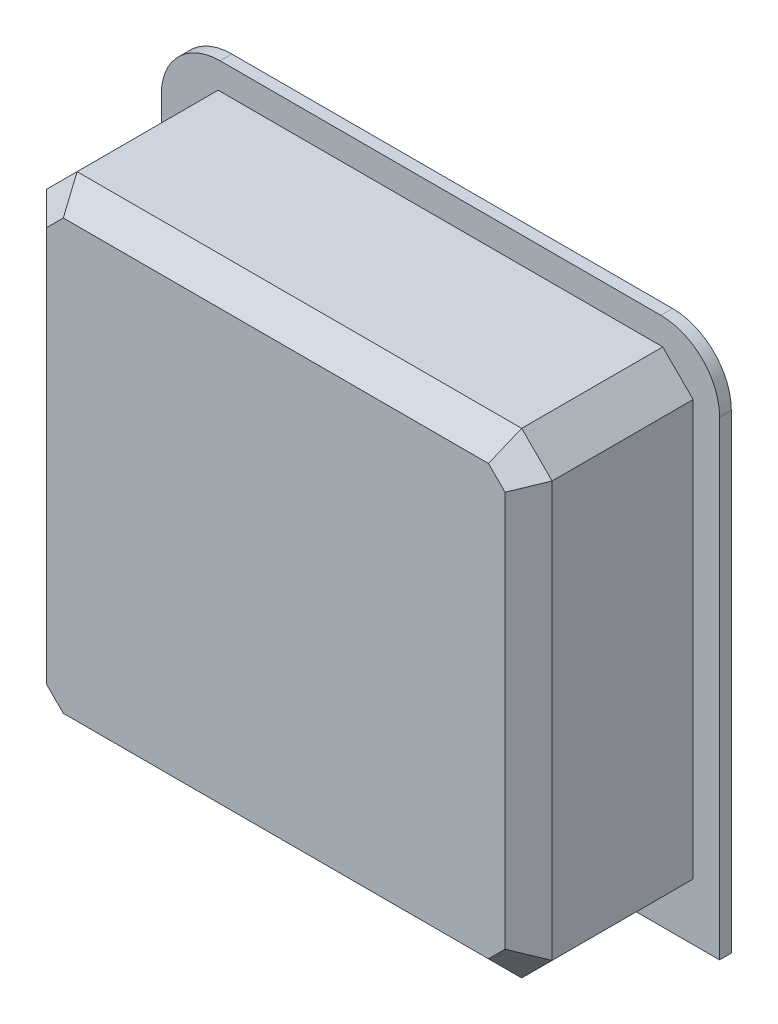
ISO-10303-21;
HEADER;
FILE_DESCRIPTION(('STEP AP214'),'2;1');
FILE_NAME('part.step','',(''),(''),'','','');
FILE_SCHEMA(('AUTOMOTIVE_DESIGN { 1 0 10303 214 1 1 1 1 }'));
ENDSEC;
DATA;
#1=APPLICATION_CONTEXT('core data for automotive mechanical design processes');
#2=APPLICATION_PROTOCOL_DEFINITION('international standard','automotive_design',2000,#1);
#3=PRODUCT_CONTEXT('',#1,'mechanical');
#4=PRODUCT('Part','Part','',(#3));
#5=PRODUCT_RELATED_PRODUCT_CATEGORY('part','',(#4));
#6=PRODUCT_DEFINITION_FORMATION('','',#4);
#7=PRODUCT_DEFINITION_CONTEXT('part definition',#1,'design');
#8=PRODUCT_DEFINITION('design','',#6,#7);
#9=PRODUCT_DEFINITION_SHAPE('','',#8);
#10=(LENGTH_UNIT() NAMED_UNIT(*) SI_UNIT(.MILLI.,.METRE.));
#11=(NAMED_UNIT(*) PLANE_ANGLE_UNIT() SI_UNIT($,.RADIAN.));
#12=(NAMED_UNIT(*) SI_UNIT($,.STERADIAN.) SOLID_ANGLE_UNIT());
#13=UNCERTAINTY_MEASURE_WITH_UNIT(LENGTH_MEASURE(1.E-05),#10,'distance_accuracy_value','');
#14=(GEOMETRIC_REPRESENTATION_CONTEXT(3) GLOBAL_UNCERTAINTY_ASSIGNED_CONTEXT((#13)) GLOBAL_UNIT_ASSIGNED_CONTEXT((#10,
#11,#12)) REPRESENTATION_CONTEXT('',''));
#15=CARTESIAN_POINT('',(0.,0.,0.));
#16=DIRECTION('',(0.,0.,1.));
#17=DIRECTION('',(1.,0.,0.));
#18=AXIS2_PLACEMENT_3D('',#15,#16,#17);
#19=CARTESIAN_POINT('',(-47.5,-45.,30.));
#20=DIRECTION('',(1.,0.,0.));
#21=DIRECTION('',(0.,0.,-1.));
#22=AXIS2_PLACEMENT_3D('',#19,#20,#21);
#23=PLANE('',#22);
#24=DIRECTION('',(0.,1.,0.));
#25=VECTOR('',#24,1.);
#26=CARTESIAN_POINT('',(-47.5,45.,4.));
#27=LINE('',#26,#25);
#28=CARTESIAN_POINT('',(-47.5,-45.,4.));
#29=VERTEX_POINT('',#28);
#30=CARTESIAN_POINT('',(-47.5,35.,4.));
#31=VERTEX_POINT('',#30);
#32=EDGE_CURVE('E407',#29,#31,#27,.T.);
#33=ORIENTED_EDGE('',*,*,#32,.T.);
#34=DIRECTION('',(0.,0.,-1.));
#35=VECTOR('',#34,1.);
#36=CARTESIAN_POINT('',(-47.5,35.,30.));
#37=LINE('',#36,#35);
#38=CARTESIAN_POINT('',(-47.5,35.,2.));
#39=VERTEX_POINT('',#38);
#40=EDGE_CURVE('E11',#31,#39,#37,.T.);
#41=ORIENTED_EDGE('',*,*,#40,.T.);
#42=DIRECTION('',(0.,1.,0.));
#43=VECTOR('',#42,1.);
#44=CARTESIAN_POINT('',(-47.5,45.,2.));
#45=LINE('',#44,#43);
#46=CARTESIAN_POINT('',(-47.5,-45.,2.));
#47=VERTEX_POINT('',#46);
#48=EDGE_CURVE('E421',#47,#39,#45,.T.);
#49=ORIENTED_EDGE('',*,*,#48,.F.);
#50=DIRECTION('',(0.,0.,-1.));
#51=VECTOR('',#50,1.);
#52=CARTESIAN_POINT('',(-47.5,-45.,30.));
#53=LINE('',#52,#51);
#54=EDGE_CURVE('E324',#29,#47,#53,.T.);
#55=ORIENTED_EDGE('',*,*,#54,.F.);
#56=EDGE_LOOP('',(#33,#41,#49,#55));
#57=FACE_BOUND('',#56,.T.);
#58=ADVANCED_FACE('F33',(#57),#23,.F.);
#59=CARTESIAN_POINT('',(47.5,-45.,30.));
#60=DIRECTION('',(0.,1.,0.));
#61=DIRECTION('',(-1.,0.,0.));
#62=AXIS2_PLACEMENT_3D('',#59,#60,#61);
#63=PLANE('',#62);
#64=DIRECTION('',(0.,0.,-1.));
#65=VECTOR('',#64,1.);
#66=CARTESIAN_POINT('',(47.5,-45.,30.));
#67=LINE('',#66,#65);
#68=CARTESIAN_POINT('',(47.5,-45.,4.));
#69=VERTEX_POINT('',#68);
#70=CARTESIAN_POINT('',(47.5,-45.,2.));
#71=VERTEX_POINT('',#70);
#72=EDGE_CURVE('E321',#69,#71,#67,.T.);
#73=ORIENTED_EDGE('',*,*,#72,.F.);
#74=DIRECTION('',(-1.,0.,0.));
#75=VECTOR('',#74,1.);
#76=CARTESIAN_POINT('',(47.5,-45.,4.));
#77=LINE('',#76,#75);
#78=EDGE_CURVE('E526',#69,#29,#77,.T.);
#79=ORIENTED_EDGE('',*,*,#78,.T.);
#80=ORIENTED_EDGE('',*,*,#54,.T.);
#81=DIRECTION('',(-1.,0.,0.));
#82=VECTOR('',#81,1.);
#83=CARTESIAN_POINT('',(47.5,-45.,2.));
#84=LINE('',#83,#82);
#85=EDGE_CURVE('E418',#71,#47,#84,.T.);
#86=ORIENTED_EDGE('',*,*,#85,.F.);
#87=EDGE_LOOP('',(#73,#79,#80,#86));
#88=FACE_BOUND('',#87,.T.);
#89=ADVANCED_FACE('F474',(#88),#63,.F.);
#90=CARTESIAN_POINT('',(47.5,-45.,30.));
#91=DIRECTION('',(-1.,0.,0.));
#92=DIRECTION('',(0.,0.,1.));
#93=AXIS2_PLACEMENT_3D('',#90,#91,#92);
#94=PLANE('',#93);
#95=DIRECTION('',(0.,-1.,0.));
#96=VECTOR('',#95,1.);
#97=CARTESIAN_POINT('',(47.5,45.,2.));
#98=LINE('',#97,#96);
#99=CARTESIAN_POINT('',(47.5,35.,2.));
#100=VERTEX_POINT('',#99);
#101=EDGE_CURVE('E414',#100,#71,#98,.T.);
#102=ORIENTED_EDGE('',*,*,#101,.F.);
#103=DIRECTION('',(0.,0.,-1.));
#104=VECTOR('',#103,1.);
#105=CARTESIAN_POINT('',(47.5,35.,30.));
#106=LINE('',#105,#104);
#107=CARTESIAN_POINT('',(47.5,35.,4.));
#108=VERTEX_POINT('',#107);
#109=EDGE_CURVE('E56',#100,#108,#106,.F.);
#110=ORIENTED_EDGE('',*,*,#109,.T.);
#111=DIRECTION('',(0.,-1.,0.));
#112=VECTOR('',#111,1.);
#113=CARTESIAN_POINT('',(47.5,45.,4.));
#114=LINE('',#113,#112);
#115=EDGE_CURVE('E398',#108,#69,#114,.T.);
#116=ORIENTED_EDGE('',*,*,#115,.T.);
#117=ORIENTED_EDGE('',*,*,#72,.T.);
#118=EDGE_LOOP('',(#102,#110,#116,#117));
#119=FACE_BOUND('',#118,.T.);
#120=ADVANCED_FACE('F415',(#119),#94,.F.);
#121=CARTESIAN_POINT('',(47.5,45.,30.));
#122=DIRECTION('',(0.,-1.,0.));
#123=DIRECTION('',(1.,0.,0.));
#124=AXIS2_PLACEMENT_3D('',#121,#122,#123);
#125=PLANE('',#124);
#126=DIRECTION('',(1.,0.,0.));
#127=VECTOR('',#126,1.);
#128=CARTESIAN_POINT('',(47.5,45.,4.));
#129=LINE('',#128,#127);
#130=CARTESIAN_POINT('',(-37.5,45.,4.));
#131=VERTEX_POINT('',#130);
#132=CARTESIAN_POINT('',(37.5,45.,4.));
#133=VERTEX_POINT('',#132);
#134=EDGE_CURVE('E396',#131,#133,#129,.T.);
#135=ORIENTED_EDGE('',*,*,#134,.T.);
#136=DIRECTION('',(0.,0.,-1.));
#137=VECTOR('',#136,1.);
#138=CARTESIAN_POINT('',(37.5,45.,30.));
#139=LINE('',#138,#137);
#140=CARTESIAN_POINT('',(37.5,45.,2.));
#141=VERTEX_POINT('',#140);
#142=EDGE_CURVE('E385',#133,#141,#139,.T.);
#143=ORIENTED_EDGE('',*,*,#142,.T.);
#144=DIRECTION('',(1.,0.,0.));
#145=VECTOR('',#144,1.);
#146=CARTESIAN_POINT('',(47.5,45.,2.));
#147=LINE('',#146,#145);
#148=CARTESIAN_POINT('',(-37.5,45.,2.));
#149=VERTEX_POINT('',#148);
#150=EDGE_CURVE('E290',#149,#141,#147,.T.);
#151=ORIENTED_EDGE('',*,*,#150,.F.);
#152=DIRECTION('',(0.,0.,-1.));
#153=VECTOR('',#152,1.);
#154=CARTESIAN_POINT('',(-37.5,45.,30.));
#155=LINE('',#154,#153);
#156=EDGE_CURVE('E360',#149,#131,#155,.F.);
#157=ORIENTED_EDGE('',*,*,#156,.T.);
#158=EDGE_LOOP('',(#135,#143,#151,#157));
#159=FACE_BOUND('',#158,.T.);
#160=ADVANCED_FACE('F402',(#159),#125,.F.);
#161=CARTESIAN_POINT('',(0.,0.,0.));
#162=DIRECTION('',(0.,0.,1.));
#163=DIRECTION('',(1.,0.,0.));
#164=AXIS2_PLACEMENT_3D('',#161,#162,#163);
#165=PLANE('',#164);
#166=DIRECTION('',(0.707106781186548,-0.707106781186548,0.));
#167=VECTOR('',#166,1.);
#168=CARTESIAN_POINT('',(43.,35.3284271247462,0.));
#169=LINE('',#168,#167);
#170=CARTESIAN_POINT('',(37.8284271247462,40.5,0.));
#171=VERTEX_POINT('',#170);
#172=CARTESIAN_POINT('',(43.,35.3284271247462,0.));
#173=VERTEX_POINT('',#172);
#174=EDGE_CURVE('E592',#171,#173,#169,.T.);
#175=ORIENTED_EDGE('',*,*,#174,.T.);
#176=DIRECTION('',(0.,-1.,0.));
#177=VECTOR('',#176,1.);
#178=CARTESIAN_POINT('',(43.,35.3284271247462,0.));
#179=LINE('',#178,#177);
#180=CARTESIAN_POINT('',(43.,-35.3284271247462,0.));
#181=VERTEX_POINT('',#180);
#182=EDGE_CURVE('E570',#173,#181,#179,.T.);
#183=ORIENTED_EDGE('',*,*,#182,.T.);
#184=DIRECTION('',(-0.707106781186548,-0.707106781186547,0.));
#185=VECTOR('',#184,1.);
#186=CARTESIAN_POINT('',(43.,-35.3284271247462,0.));
#187=LINE('',#186,#185);
#188=CARTESIAN_POINT('',(37.8284271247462,-40.5,0.));
#189=VERTEX_POINT('',#188);
#190=EDGE_CURVE('E573',#181,#189,#187,.T.);
#191=ORIENTED_EDGE('',*,*,#190,.T.);
#192=DIRECTION('',(-1.,0.,0.));
#193=VECTOR('',#192,1.);
#194=CARTESIAN_POINT('',(37.8284271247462,-40.5,0.));
#195=LINE('',#194,#193);
#196=CARTESIAN_POINT('',(-37.8284271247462,-40.5,0.));
#197=VERTEX_POINT('',#196);
#198=EDGE_CURVE('E577',#189,#197,#195,.T.);
#199=ORIENTED_EDGE('',*,*,#198,.T.);
#200=DIRECTION('',(-0.707106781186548,0.707106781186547,0.));
#201=VECTOR('',#200,1.);
#202=CARTESIAN_POINT('',(-43.,-35.3284271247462,0.));
#203=LINE('',#202,#201);
#204=CARTESIAN_POINT('',(-43.,-35.3284271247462,0.));
#205=VERTEX_POINT('',#204);
#206=EDGE_CURVE('E580',#197,#205,#203,.T.);
#207=ORIENTED_EDGE('',*,*,#206,.T.);
#208=DIRECTION('',(0.,1.,0.));
#209=VECTOR('',#208,1.);
#210=CARTESIAN_POINT('',(-43.,35.3284271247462,0.));
#211=LINE('',#210,#209);
#212=CARTESIAN_POINT('',(-43.,35.3284271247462,0.));
#213=VERTEX_POINT('',#212);
#214=EDGE_CURVE('E583',#205,#213,#211,.T.);
#215=ORIENTED_EDGE('',*,*,#214,.T.);
#216=DIRECTION('',(0.707106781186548,0.707106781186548,0.));
#217=VECTOR('',#216,1.);
#218=CARTESIAN_POINT('',(-43.,35.3284271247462,0.));
#219=LINE('',#218,#217);
#220=CARTESIAN_POINT('',(-37.8284271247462,40.5,0.));
#221=VERTEX_POINT('',#220);
#222=EDGE_CURVE('E586',#213,#221,#219,.T.);
#223=ORIENTED_EDGE('',*,*,#222,.T.);
#224=DIRECTION('',(1.,0.,0.));
#225=VECTOR('',#224,1.);
#226=CARTESIAN_POINT('',(37.8284271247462,40.5,0.));
#227=LINE('',#226,#225);
#228=EDGE_CURVE('E589',#221,#171,#227,.T.);
#229=ORIENTED_EDGE('',*,*,#228,.T.);
#230=EDGE_LOOP('',(#175,#183,#191,#199,#207,#215,#223,#229));
#231=FACE_BOUND('',#230,.T.);
#232=DIRECTION('',(-0.70710678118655,-0.707106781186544,0.));
#233=VECTOR('',#232,1.);
#234=CARTESIAN_POINT('',(-41.,34.5,0.));
#235=LINE('',#234,#233);
#236=CARTESIAN_POINT('',(-37.,38.5,0.));
#237=VERTEX_POINT('',#236);
#238=CARTESIAN_POINT('',(-41.,34.5,0.));
#239=VERTEX_POINT('',#238);
#240=EDGE_CURVE('E286',#237,#239,#235,.T.);
#241=ORIENTED_EDGE('',*,*,#240,.T.);
#242=DIRECTION('',(0.,-1.,0.));
#243=VECTOR('',#242,1.);
#244=CARTESIAN_POINT('',(-41.,-34.5,0.));
#245=LINE('',#244,#243);
#246=CARTESIAN_POINT('',(-41.,-34.5,0.));
#247=VERTEX_POINT('',#246);
#248=EDGE_CURVE('E289',#239,#247,#245,.T.);
#249=ORIENTED_EDGE('',*,*,#248,.T.);
#250=DIRECTION('',(0.707106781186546,-0.707106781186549,0.));
#251=VECTOR('',#250,1.);
#252=CARTESIAN_POINT('',(-41.,-34.5,0.));
#253=LINE('',#252,#251);
#254=CARTESIAN_POINT('',(-37.,-38.5,0.));
#255=VERTEX_POINT('',#254);
#256=EDGE_CURVE('E293',#247,#255,#253,.T.);
#257=ORIENTED_EDGE('',*,*,#256,.T.);
#258=DIRECTION('',(1.,0.,0.));
#259=VECTOR('',#258,1.);
#260=CARTESIAN_POINT('',(37.,-38.5,0.));
#261=LINE('',#260,#259);
#262=CARTESIAN_POINT('',(37.,-38.5,0.));
#263=VERTEX_POINT('',#262);
#264=EDGE_CURVE('E296',#255,#263,#261,.T.);
#265=ORIENTED_EDGE('',*,*,#264,.T.);
#266=DIRECTION('',(0.707106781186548,0.707106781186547,0.));
#267=VECTOR('',#266,1.);
#268=CARTESIAN_POINT('',(41.,-34.5,0.));
#269=LINE('',#268,#267);
#270=CARTESIAN_POINT('',(41.,-34.5,0.));
#271=VERTEX_POINT('',#270);
#272=EDGE_CURVE('E299',#263,#271,#269,.T.);
#273=ORIENTED_EDGE('',*,*,#272,.T.);
#274=DIRECTION('',(0.,1.,0.));
#275=VECTOR('',#274,1.);
#276=CARTESIAN_POINT('',(41.,34.5,0.));
#277=LINE('',#276,#275);
#278=CARTESIAN_POINT('',(41.,34.5,0.));
#279=VERTEX_POINT('',#278);
#280=EDGE_CURVE('E302',#271,#279,#277,.T.);
#281=ORIENTED_EDGE('',*,*,#280,.T.);
#282=DIRECTION('',(-0.707106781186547,0.707106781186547,0.));
#283=VECTOR('',#282,1.);
#284=CARTESIAN_POINT('',(37.,38.5,0.));
#285=LINE('',#284,#283);
#286=CARTESIAN_POINT('',(37.,38.5,0.));
#287=VERTEX_POINT('',#286);
#288=EDGE_CURVE('E305',#279,#287,#285,.T.);
#289=ORIENTED_EDGE('',*,*,#288,.T.);
#290=DIRECTION('',(-1.,0.,0.));
#291=VECTOR('',#290,1.);
#292=CARTESIAN_POINT('',(-37.,38.5,0.));
#293=LINE('',#292,#291);
#294=EDGE_CURVE('E272',#287,#237,#293,.T.);
#295=ORIENTED_EDGE('',*,*,#294,.T.);
#296=EDGE_LOOP('',(#241,#249,#257,#265,#273,#281,#289,#295));
#297=FACE_BOUND('',#296,.T.);
#298=ADVANCED_FACE('F450',(#231,#297),#165,.F.);
#299=CARTESIAN_POINT('',(-41.,34.5,30.));
#300=DIRECTION('',(0.707106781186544,-0.70710678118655,0.));
#301=DIRECTION('',(0.707106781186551,0.707106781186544,0.));
#302=AXIS2_PLACEMENT_3D('',#299,#300,#301);
#303=PLANE('',#302);
#304=ORIENTED_EDGE('',*,*,#240,.F.);
#305=DIRECTION('',(0.,0.,-1.));
#306=VECTOR('',#305,1.);
#307=CARTESIAN_POINT('',(-37.,38.5,30.));
#308=LINE('',#307,#306);
#309=CARTESIAN_POINT('',(-37.,38.5,30.));
#310=VERTEX_POINT('',#309);
#311=EDGE_CURVE('E266',#310,#237,#308,.T.);
#312=ORIENTED_EDGE('',*,*,#311,.F.);
#313=DIRECTION('',(-0.70710678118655,-0.707106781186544,0.));
#314=VECTOR('',#313,1.);
#315=CARTESIAN_POINT('',(-41.,34.5,30.));
#316=LINE('',#315,#314);
#317=CARTESIAN_POINT('',(-41.,34.5,30.));
#318=VERTEX_POINT('',#317);
#319=EDGE_CURVE('E262',#310,#318,#316,.T.);
#320=ORIENTED_EDGE('',*,*,#319,.T.);
#321=DIRECTION('',(0.,0.,-1.));
#322=VECTOR('',#321,1.);
#323=CARTESIAN_POINT('',(-41.,34.5,30.));
#324=LINE('',#323,#322);
#325=EDGE_CURVE('E318',#318,#239,#324,.T.);
#326=ORIENTED_EDGE('',*,*,#325,.T.);
#327=EDGE_LOOP('',(#304,#312,#320,#326));
#328=FACE_BOUND('',#327,.T.);
#329=ADVANCED_FACE('F463',(#328),#303,.T.);
#330=CARTESIAN_POINT('',(-41.,-34.5,30.));
#331=DIRECTION('',(1.,0.,0.));
#332=DIRECTION('',(0.,1.,0.));
#333=AXIS2_PLACEMENT_3D('',#330,#331,#332);
#334=PLANE('',#333);
#335=ORIENTED_EDGE('',*,*,#248,.F.);
#336=ORIENTED_EDGE('',*,*,#325,.F.);
#337=DIRECTION('',(0.,-1.,0.));
#338=VECTOR('',#337,1.);
#339=CARTESIAN_POINT('',(-41.,-34.5,30.));
#340=LINE('',#339,#338);
#341=CARTESIAN_POINT('',(-41.,-34.5,30.));
#342=VERTEX_POINT('',#341);
#343=EDGE_CURVE('E432',#318,#342,#340,.T.);
#344=ORIENTED_EDGE('',*,*,#343,.T.);
#345=DIRECTION('',(0.,0.,-1.));
#346=VECTOR('',#345,1.);
#347=CARTESIAN_POINT('',(-41.,-34.5,30.));
#348=LINE('',#347,#346);
#349=EDGE_CURVE('E316',#342,#247,#348,.T.);
#350=ORIENTED_EDGE('',*,*,#349,.T.);
#351=EDGE_LOOP('',(#335,#336,#344,#350));
#352=FACE_BOUND('',#351,.T.);
#353=ADVANCED_FACE('F460',(#352),#334,.T.);
#354=CARTESIAN_POINT('',(-41.,-34.5,30.));
#355=DIRECTION('',(0.707106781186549,0.707106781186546,0.));
#356=DIRECTION('',(-0.707106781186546,0.707106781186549,0.));
#357=AXIS2_PLACEMENT_3D('',#354,#355,#356);
#358=PLANE('',#357);
#359=ORIENTED_EDGE('',*,*,#256,.F.);
#360=ORIENTED_EDGE('',*,*,#349,.F.);
#361=DIRECTION('',(0.707106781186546,-0.707106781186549,0.));
#362=VECTOR('',#361,1.);
#363=CARTESIAN_POINT('',(-41.,-34.5,30.));
#364=LINE('',#363,#362);
#365=CARTESIAN_POINT('',(-37.,-38.5,30.));
#366=VERTEX_POINT('',#365);
#367=EDGE_CURVE('E435',#342,#366,#364,.T.);
#368=ORIENTED_EDGE('',*,*,#367,.T.);
#369=DIRECTION('',(0.,0.,-1.));
#370=VECTOR('',#369,1.);
#371=CARTESIAN_POINT('',(-37.,-38.5,30.));
#372=LINE('',#371,#370);
#373=EDGE_CURVE('E314',#366,#255,#372,.T.);
#374=ORIENTED_EDGE('',*,*,#373,.T.);
#375=EDGE_LOOP('',(#359,#360,#368,#374));
#376=FACE_BOUND('',#375,.T.);
#377=ADVANCED_FACE('F458',(#376),#358,.T.);
#378=CARTESIAN_POINT('',(37.,-38.5,30.));
#379=DIRECTION('',(0.,1.,0.));
#380=DIRECTION('',(-1.,0.,0.));
#381=AXIS2_PLACEMENT_3D('',#378,#379,#380);
#382=PLANE('',#381);
#383=ORIENTED_EDGE('',*,*,#264,.F.);
#384=ORIENTED_EDGE('',*,*,#373,.F.);
#385=DIRECTION('',(1.,0.,0.));
#386=VECTOR('',#385,1.);
#387=CARTESIAN_POINT('',(37.,-38.5,30.));
#388=LINE('',#387,#386);
#389=CARTESIAN_POINT('',(37.,-38.5,30.));
#390=VERTEX_POINT('',#389);
#391=EDGE_CURVE('E438',#366,#390,#388,.T.);
#392=ORIENTED_EDGE('',*,*,#391,.T.);
#393=DIRECTION('',(0.,0.,-1.));
#394=VECTOR('',#393,1.);
#395=CARTESIAN_POINT('',(37.,-38.5,30.));
#396=LINE('',#395,#394);
#397=EDGE_CURVE('E312',#390,#263,#396,.T.);
#398=ORIENTED_EDGE('',*,*,#397,.T.);
#399=EDGE_LOOP('',(#383,#384,#392,#398));
#400=FACE_BOUND('',#399,.T.);
#401=ADVANCED_FACE('F455',(#400),#382,.T.);
#402=CARTESIAN_POINT('',(41.,-34.5,30.));
#403=DIRECTION('',(-0.707106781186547,0.707106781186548,0.));
#404=DIRECTION('',(-0.707106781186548,-0.707106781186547,0.));
#405=AXIS2_PLACEMENT_3D('',#402,#403,#404);
#406=PLANE('',#405);
#407=ORIENTED_EDGE('',*,*,#272,.F.);
#408=ORIENTED_EDGE('',*,*,#397,.F.);
#409=DIRECTION('',(0.707106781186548,0.707106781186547,0.));
#410=VECTOR('',#409,1.);
#411=CARTESIAN_POINT('',(41.,-34.5,30.));
#412=LINE('',#411,#410);
#413=CARTESIAN_POINT('',(41.,-34.5,30.));
#414=VERTEX_POINT('',#413);
#415=EDGE_CURVE('E282',#390,#414,#412,.T.);
#416=ORIENTED_EDGE('',*,*,#415,.T.);
#417=DIRECTION('',(0.,0.,-1.));
#418=VECTOR('',#417,1.);
#419=CARTESIAN_POINT('',(41.,-34.5,30.));
#420=LINE('',#419,#418);
#421=EDGE_CURVE('E310',#414,#271,#420,.T.);
#422=ORIENTED_EDGE('',*,*,#421,.T.);
#423=EDGE_LOOP('',(#407,#408,#416,#422));
#424=FACE_BOUND('',#423,.T.);
#425=ADVANCED_FACE('F445',(#424),#406,.T.);
#426=CARTESIAN_POINT('',(41.,34.5,30.));
#427=DIRECTION('',(-1.,0.,0.));
#428=DIRECTION('',(0.,0.,1.));
#429=AXIS2_PLACEMENT_3D('',#426,#427,#428);
#430=PLANE('',#429);
#431=ORIENTED_EDGE('',*,*,#280,.F.);
#432=ORIENTED_EDGE('',*,*,#421,.F.);
#433=DIRECTION('',(0.,1.,0.));
#434=VECTOR('',#433,1.);
#435=CARTESIAN_POINT('',(41.,34.5,30.));
#436=LINE('',#435,#434);
#437=CARTESIAN_POINT('',(41.,34.5,30.));
#438=VERTEX_POINT('',#437);
#439=EDGE_CURVE('E280',#414,#438,#436,.T.);
#440=ORIENTED_EDGE('',*,*,#439,.T.);
#441=DIRECTION('',(0.,0.,-1.));
#442=VECTOR('',#441,1.);
#443=CARTESIAN_POINT('',(41.,34.5,30.));
#444=LINE('',#443,#442);
#445=EDGE_CURVE('E276',#438,#279,#444,.T.);
#446=ORIENTED_EDGE('',*,*,#445,.T.);
#447=EDGE_LOOP('',(#431,#432,#440,#446));
#448=FACE_BOUND('',#447,.T.);
#449=ADVANCED_FACE('F448',(#448),#430,.T.);
#450=CARTESIAN_POINT('',(37.,38.5,30.));
#451=DIRECTION('',(-0.707106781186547,-0.707106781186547,0.));
#452=DIRECTION('',(0.707106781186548,-0.707106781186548,0.));
#453=AXIS2_PLACEMENT_3D('',#450,#451,#452);
#454=PLANE('',#453);
#455=ORIENTED_EDGE('',*,*,#288,.F.);
#456=ORIENTED_EDGE('',*,*,#445,.F.);
#457=DIRECTION('',(-0.707106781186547,0.707106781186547,0.));
#458=VECTOR('',#457,1.);
#459=CARTESIAN_POINT('',(37.,38.5,30.));
#460=LINE('',#459,#458);
#461=CARTESIAN_POINT('',(37.,38.5,30.));
#462=VERTEX_POINT('',#461);
#463=EDGE_CURVE('E259',#438,#462,#460,.T.);
#464=ORIENTED_EDGE('',*,*,#463,.T.);
#465=DIRECTION('',(0.,0.,-1.));
#466=VECTOR('',#465,1.);
#467=CARTESIAN_POINT('',(37.,38.5,30.));
#468=LINE('',#467,#466);
#469=EDGE_CURVE('E269',#462,#287,#468,.T.);
#470=ORIENTED_EDGE('',*,*,#469,.T.);
#471=EDGE_LOOP('',(#455,#456,#464,#470));
#472=FACE_BOUND('',#471,.T.);
#473=ADVANCED_FACE('F279',(#472),#454,.T.);
#474=CARTESIAN_POINT('',(-37.,38.5,30.));
#475=DIRECTION('',(0.,-1.,0.));
#476=DIRECTION('',(1.,0.,0.));
#477=AXIS2_PLACEMENT_3D('',#474,#475,#476);
#478=PLANE('',#477);
#479=ORIENTED_EDGE('',*,*,#294,.F.);
#480=ORIENTED_EDGE('',*,*,#469,.F.);
#481=DIRECTION('',(-1.,0.,0.));
#482=VECTOR('',#481,1.);
#483=CARTESIAN_POINT('',(-37.,38.5,30.));
#484=LINE('',#483,#482);
#485=EDGE_CURVE('E255',#462,#310,#484,.T.);
#486=ORIENTED_EDGE('',*,*,#485,.T.);
#487=ORIENTED_EDGE('',*,*,#311,.T.);
#488=EDGE_LOOP('',(#479,#480,#486,#487));
#489=FACE_BOUND('',#488,.T.);
#490=ADVANCED_FACE('F270',(#489),#478,.T.);
#491=CARTESIAN_POINT('',(0.,0.,2.));
#492=DIRECTION('',(0.,0.,-1.));
#493=DIRECTION('',(-1.,0.,0.));
#494=AXIS2_PLACEMENT_3D('',#491,#492,#493);
#495=PLANE('',#494);
#496=ORIENTED_EDGE('',*,*,#150,.T.);
#497=CARTESIAN_POINT('',(37.5,35.,2.));
#498=DIRECTION('',(0.,0.,-1.));
#499=DIRECTION('',(-1.,0.,0.));
#500=AXIS2_PLACEMENT_3D('',#497,#498,#499);
#501=CIRCLE('',#500,10.);
#502=EDGE_CURVE('E390',#141,#100,#501,.T.);
#503=ORIENTED_EDGE('',*,*,#502,.T.);
#504=ORIENTED_EDGE('',*,*,#101,.T.);
#505=ORIENTED_EDGE('',*,*,#85,.T.);
#506=ORIENTED_EDGE('',*,*,#48,.T.);
#507=CARTESIAN_POINT('',(-37.5,35.,2.));
#508=DIRECTION('',(0.,0.,-1.));
#509=DIRECTION('',(-1.,0.,0.));
#510=AXIS2_PLACEMENT_3D('',#507,#508,#509);
#511=CIRCLE('',#510,10.);
#512=EDGE_CURVE('E388',#39,#149,#511,.T.);
#513=ORIENTED_EDGE('',*,*,#512,.T.);
#514=EDGE_LOOP('',(#496,#503,#504,#505,#506,#513));
#515=FACE_BOUND('',#514,.T.);
#516=DIRECTION('',(0.,-1.,0.));
#517=VECTOR('',#516,1.);
#518=CARTESIAN_POINT('',(43.,35.3284271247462,2.));
#519=LINE('',#518,#517);
#520=CARTESIAN_POINT('',(43.,35.3284271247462,2.));
#521=VERTEX_POINT('',#520);
#522=CARTESIAN_POINT('',(43.,-35.3284271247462,2.));
#523=VERTEX_POINT('',#522);
#524=EDGE_CURVE('E406',#521,#523,#519,.T.);
#525=ORIENTED_EDGE('',*,*,#524,.F.);
#526=DIRECTION('',(0.707106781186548,-0.707106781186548,0.));
#527=VECTOR('',#526,1.);
#528=CARTESIAN_POINT('',(43.,35.3284271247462,2.));
#529=LINE('',#528,#527);
#530=CARTESIAN_POINT('',(37.8284271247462,40.5,2.));
#531=VERTEX_POINT('',#530);
#532=EDGE_CURVE('E574',#531,#521,#529,.T.);
#533=ORIENTED_EDGE('',*,*,#532,.F.);
#534=DIRECTION('',(1.,0.,0.));
#535=VECTOR('',#534,1.);
#536=CARTESIAN_POINT('',(37.8284271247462,40.5,2.));
#537=LINE('',#536,#535);
#538=CARTESIAN_POINT('',(-37.8284271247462,40.5,2.));
#539=VERTEX_POINT('',#538);
#540=EDGE_CURVE('E613',#539,#531,#537,.T.);
#541=ORIENTED_EDGE('',*,*,#540,.F.);
#542=DIRECTION('',(0.707106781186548,0.707106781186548,0.));
#543=VECTOR('',#542,1.);
#544=CARTESIAN_POINT('',(-43.,35.3284271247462,2.));
#545=LINE('',#544,#543);
#546=CARTESIAN_POINT('',(-43.,35.3284271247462,2.));
#547=VERTEX_POINT('',#546);
#548=EDGE_CURVE('E610',#547,#539,#545,.T.);
#549=ORIENTED_EDGE('',*,*,#548,.F.);
#550=DIRECTION('',(0.,1.,0.));
#551=VECTOR('',#550,1.);
#552=CARTESIAN_POINT('',(-43.,35.3284271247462,2.));
#553=LINE('',#552,#551);
#554=CARTESIAN_POINT('',(-43.,-35.3284271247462,2.));
#555=VERTEX_POINT('',#554);
#556=EDGE_CURVE('E607',#555,#547,#553,.T.);
#557=ORIENTED_EDGE('',*,*,#556,.F.);
#558=DIRECTION('',(-0.707106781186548,0.707106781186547,0.));
#559=VECTOR('',#558,1.);
#560=CARTESIAN_POINT('',(-43.,-35.3284271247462,2.));
#561=LINE('',#560,#559);
#562=CARTESIAN_POINT('',(-37.8284271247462,-40.5,2.));
#563=VERTEX_POINT('',#562);
#564=EDGE_CURVE('E604',#563,#555,#561,.T.);
#565=ORIENTED_EDGE('',*,*,#564,.F.);
#566=DIRECTION('',(-1.,0.,0.));
#567=VECTOR('',#566,1.);
#568=CARTESIAN_POINT('',(37.8284271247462,-40.5,2.));
#569=LINE('',#568,#567);
#570=CARTESIAN_POINT('',(37.8284271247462,-40.5,2.));
#571=VERTEX_POINT('',#570);
#572=EDGE_CURVE('E601',#571,#563,#569,.T.);
#573=ORIENTED_EDGE('',*,*,#572,.F.);
#574=DIRECTION('',(-0.707106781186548,-0.707106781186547,0.));
#575=VECTOR('',#574,1.);
#576=CARTESIAN_POINT('',(43.,-35.3284271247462,2.));
#577=LINE('',#576,#575);
#578=EDGE_CURVE('E598',#523,#571,#577,.T.);
#579=ORIENTED_EDGE('',*,*,#578,.F.);
#580=EDGE_LOOP('',(#525,#533,#541,#549,#557,#565,#573,#579));
#581=FACE_BOUND('',#580,.T.);
#582=ADVANCED_FACE('F411',(#515,#581),#495,.T.);
#583=CARTESIAN_POINT('',(43.,35.3284271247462,0.));
#584=DIRECTION('',(-1.,0.,0.));
#585=DIRECTION('',(0.,-1.,0.));
#586=AXIS2_PLACEMENT_3D('',#583,#584,#585);
#587=PLANE('',#586);
#588=ORIENTED_EDGE('',*,*,#524,.T.);
#589=DIRECTION('',(0.,0.,1.));
#590=VECTOR('',#589,1.);
#591=CARTESIAN_POINT('',(43.,-35.3284271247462,0.));
#592=LINE('',#591,#590);
#593=EDGE_CURVE('E419',#181,#523,#592,.T.);
#594=ORIENTED_EDGE('',*,*,#593,.F.);
#595=ORIENTED_EDGE('',*,*,#182,.F.);
#596=DIRECTION('',(0.,0.,1.));
#597=VECTOR('',#596,1.);
#598=CARTESIAN_POINT('',(43.,35.3284271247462,0.));
#599=LINE('',#598,#597);
#600=EDGE_CURVE('E595',#173,#521,#599,.T.);
#601=ORIENTED_EDGE('',*,*,#600,.T.);
#602=EDGE_LOOP('',(#588,#594,#595,#601));
#603=FACE_BOUND('',#602,.T.);
#604=ADVANCED_FACE('F639',(#603),#587,.F.);
#605=CARTESIAN_POINT('',(43.,-35.3284271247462,0.));
#606=DIRECTION('',(-0.707106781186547,0.707106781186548,0.));
#607=DIRECTION('',(-0.707106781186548,-0.707106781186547,0.));
#608=AXIS2_PLACEMENT_3D('',#605,#606,#607);
#609=PLANE('',#608);
#610=ORIENTED_EDGE('',*,*,#578,.T.);
#611=DIRECTION('',(0.,0.,1.));
#612=VECTOR('',#611,1.);
#613=CARTESIAN_POINT('',(37.8284271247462,-40.5,0.));
#614=LINE('',#613,#612);
#615=EDGE_CURVE('E424',#189,#571,#614,.T.);
#616=ORIENTED_EDGE('',*,*,#615,.F.);
#617=ORIENTED_EDGE('',*,*,#190,.F.);
#618=ORIENTED_EDGE('',*,*,#593,.T.);
#619=EDGE_LOOP('',(#610,#616,#617,#618));
#620=FACE_BOUND('',#619,.T.);
#621=ADVANCED_FACE('F637',(#620),#609,.F.);
#622=CARTESIAN_POINT('',(37.8284271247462,-40.5,0.));
#623=DIRECTION('',(0.,1.,0.));
#624=DIRECTION('',(0.,0.,1.));
#625=AXIS2_PLACEMENT_3D('',#622,#623,#624);
#626=PLANE('',#625);
#627=ORIENTED_EDGE('',*,*,#572,.T.);
#628=DIRECTION('',(0.,0.,1.));
#629=VECTOR('',#628,1.);
#630=CARTESIAN_POINT('',(-37.8284271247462,-40.5,0.));
#631=LINE('',#630,#629);
#632=EDGE_CURVE('E628',#197,#563,#631,.T.);
#633=ORIENTED_EDGE('',*,*,#632,.F.);
#634=ORIENTED_EDGE('',*,*,#198,.F.);
#635=ORIENTED_EDGE('',*,*,#615,.T.);
#636=EDGE_LOOP('',(#627,#633,#634,#635));
#637=FACE_BOUND('',#636,.T.);
#638=ADVANCED_FACE('F632',(#637),#626,.F.);
#639=CARTESIAN_POINT('',(-43.,-35.3284271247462,0.));
#640=DIRECTION('',(0.707106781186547,0.707106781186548,0.));
#641=DIRECTION('',(-0.707106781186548,0.707106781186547,0.));
#642=AXIS2_PLACEMENT_3D('',#639,#640,#641);
#643=PLANE('',#642);
#644=ORIENTED_EDGE('',*,*,#564,.T.);
#645=DIRECTION('',(0.,0.,1.));
#646=VECTOR('',#645,1.);
#647=CARTESIAN_POINT('',(-43.,-35.3284271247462,0.));
#648=LINE('',#647,#646);
#649=EDGE_CURVE('E626',#205,#555,#648,.T.);
#650=ORIENTED_EDGE('',*,*,#649,.F.);
#651=ORIENTED_EDGE('',*,*,#206,.F.);
#652=ORIENTED_EDGE('',*,*,#632,.T.);
#653=EDGE_LOOP('',(#644,#650,#651,#652));
#654=FACE_BOUND('',#653,.T.);
#655=ADVANCED_FACE('F657',(#654),#643,.F.);
#656=CARTESIAN_POINT('',(-43.,35.3284271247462,0.));
#657=DIRECTION('',(1.,0.,0.));
#658=DIRECTION('',(0.,1.,0.));
#659=AXIS2_PLACEMENT_3D('',#656,#657,#658);
#660=PLANE('',#659);
#661=ORIENTED_EDGE('',*,*,#556,.T.);
#662=DIRECTION('',(0.,0.,1.));
#663=VECTOR('',#662,1.);
#664=CARTESIAN_POINT('',(-43.,35.3284271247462,0.));
#665=LINE('',#664,#663);
#666=EDGE_CURVE('E624',#213,#547,#665,.T.);
#667=ORIENTED_EDGE('',*,*,#666,.F.);
#668=ORIENTED_EDGE('',*,*,#214,.F.);
#669=ORIENTED_EDGE('',*,*,#649,.T.);
#670=EDGE_LOOP('',(#661,#667,#668,#669));
#671=FACE_BOUND('',#670,.T.);
#672=ADVANCED_FACE('F653',(#671),#660,.F.);
#673=CARTESIAN_POINT('',(-43.,35.3284271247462,0.));
#674=DIRECTION('',(0.707106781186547,-0.707106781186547,0.));
#675=DIRECTION('',(0.707106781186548,0.707106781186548,0.));
#676=AXIS2_PLACEMENT_3D('',#673,#674,#675);
#677=PLANE('',#676);
#678=ORIENTED_EDGE('',*,*,#548,.T.);
#679=DIRECTION('',(0.,0.,1.));
#680=VECTOR('',#679,1.);
#681=CARTESIAN_POINT('',(-37.8284271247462,40.5,0.));
#682=LINE('',#681,#680);
#683=EDGE_CURVE('E622',#221,#539,#682,.T.);
#684=ORIENTED_EDGE('',*,*,#683,.F.);
#685=ORIENTED_EDGE('',*,*,#222,.F.);
#686=ORIENTED_EDGE('',*,*,#666,.T.);
#687=EDGE_LOOP('',(#678,#684,#685,#686));
#688=FACE_BOUND('',#687,.T.);
#689=ADVANCED_FACE('F651',(#688),#677,.F.);
#690=CARTESIAN_POINT('',(37.8284271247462,40.5,0.));
#691=DIRECTION('',(0.,-1.,0.));
#692=DIRECTION('',(0.,0.,-1.));
#693=AXIS2_PLACEMENT_3D('',#690,#691,#692);
#694=PLANE('',#693);
#695=ORIENTED_EDGE('',*,*,#540,.T.);
#696=DIRECTION('',(0.,0.,1.));
#697=VECTOR('',#696,1.);
#698=CARTESIAN_POINT('',(37.8284271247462,40.5,0.));
#699=LINE('',#698,#697);
#700=EDGE_CURVE('E620',#171,#531,#699,.T.);
#701=ORIENTED_EDGE('',*,*,#700,.F.);
#702=ORIENTED_EDGE('',*,*,#228,.F.);
#703=ORIENTED_EDGE('',*,*,#683,.T.);
#704=EDGE_LOOP('',(#695,#701,#702,#703));
#705=FACE_BOUND('',#704,.T.);
#706=ADVANCED_FACE('F646',(#705),#694,.F.);
#707=CARTESIAN_POINT('',(43.,35.3284271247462,0.));
#708=DIRECTION('',(-0.707106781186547,-0.707106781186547,0.));
#709=DIRECTION('',(0.707106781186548,-0.707106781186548,0.));
#710=AXIS2_PLACEMENT_3D('',#707,#708,#709);
#711=PLANE('',#710);
#712=ORIENTED_EDGE('',*,*,#532,.T.);
#713=ORIENTED_EDGE('',*,*,#600,.F.);
#714=ORIENTED_EDGE('',*,*,#174,.F.);
#715=ORIENTED_EDGE('',*,*,#700,.T.);
#716=EDGE_LOOP('',(#712,#713,#714,#715));
#717=FACE_BOUND('',#716,.T.);
#718=ADVANCED_FACE('F658',(#717),#711,.F.);
#719=CARTESIAN_POINT('',(-37.8284271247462,40.5,160.862523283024));
#720=DIRECTION('',(0.,1.,0.));
#721=DIRECTION('',(0.,0.,1.));
#722=AXIS2_PLACEMENT_3D('',#719,#720,#721);
#723=PLANE('',#722);
#724=DIRECTION('',(0.,0.,-1.));
#725=VECTOR('',#724,1.);
#726=CARTESIAN_POINT('',(-37.8284271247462,40.5,160.862523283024));
#727=LINE('',#726,#725);
#728=CARTESIAN_POINT('',(-37.8284271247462,40.5,28.));
#729=VERTEX_POINT('',#728);
#730=CARTESIAN_POINT('',(-37.8284271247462,40.5,4.));
#731=VERTEX_POINT('',#730);
#732=EDGE_CURVE('E383',#729,#731,#727,.T.);
#733=ORIENTED_EDGE('',*,*,#732,.F.);
#734=DIRECTION('',(1.,0.,0.));
#735=VECTOR('',#734,1.);
#736=CARTESIAN_POINT('',(37.8284271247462,40.5,28.));
#737=LINE('',#736,#735);
#738=CARTESIAN_POINT('',(37.8284271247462,40.5,28.));
#739=VERTEX_POINT('',#738);
#740=EDGE_CURVE('E346',#729,#739,#737,.T.);
#741=ORIENTED_EDGE('',*,*,#740,.T.);
#742=DIRECTION('',(0.,0.,-1.));
#743=VECTOR('',#742,1.);
#744=CARTESIAN_POINT('',(37.8284271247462,40.5,160.862523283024));
#745=LINE('',#744,#743);
#746=CARTESIAN_POINT('',(37.8284271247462,40.5,4.));
#747=VERTEX_POINT('',#746);
#748=EDGE_CURVE('E556',#739,#747,#745,.T.);
#749=ORIENTED_EDGE('',*,*,#748,.T.);
#750=DIRECTION('',(1.,0.,0.));
#751=VECTOR('',#750,1.);
#752=CARTESIAN_POINT('',(-37.8284271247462,40.5,4.));
#753=LINE('',#752,#751);
#754=EDGE_CURVE('E559',#731,#747,#753,.T.);
#755=ORIENTED_EDGE('',*,*,#754,.F.);
#756=EDGE_LOOP('',(#733,#741,#749,#755));
#757=FACE_BOUND('',#756,.T.);
#758=ADVANCED_FACE('F660',(#757),#723,.T.);
#759=CARTESIAN_POINT('',(-43.,35.3284271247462,160.862523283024));
#760=DIRECTION('',(-0.707106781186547,0.707106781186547,0.));
#761=DIRECTION('',(-0.707106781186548,-0.707106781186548,0.));
#762=AXIS2_PLACEMENT_3D('',#759,#760,#761);
#763=PLANE('',#762);
#764=DIRECTION('',(0.,0.,-1.));
#765=VECTOR('',#764,1.);
#766=CARTESIAN_POINT('',(-43.,35.3284271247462,160.862523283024));
#767=LINE('',#766,#765);
#768=CARTESIAN_POINT('',(-43.,35.3284271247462,28.));
#769=VERTEX_POINT('',#768);
#770=CARTESIAN_POINT('',(-43.,35.3284271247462,4.));
#771=VERTEX_POINT('',#770);
#772=EDGE_CURVE('E536',#769,#771,#767,.T.);
#773=ORIENTED_EDGE('',*,*,#772,.F.);
#774=DIRECTION('',(0.707106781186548,0.707106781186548,0.));
#775=VECTOR('',#774,1.);
#776=CARTESIAN_POINT('',(-37.8284271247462,40.5,28.));
#777=LINE('',#776,#775);
#778=EDGE_CURVE('E343',#769,#729,#777,.T.);
#779=ORIENTED_EDGE('',*,*,#778,.T.);
#780=ORIENTED_EDGE('',*,*,#732,.T.);
#781=DIRECTION('',(0.707106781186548,0.707106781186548,0.));
#782=VECTOR('',#781,1.);
#783=CARTESIAN_POINT('',(-43.,35.3284271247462,4.));
#784=LINE('',#783,#782);
#785=EDGE_CURVE('E532',#771,#731,#784,.T.);
#786=ORIENTED_EDGE('',*,*,#785,.F.);
#787=EDGE_LOOP('',(#773,#779,#780,#786));
#788=FACE_BOUND('',#787,.T.);
#789=ADVANCED_FACE('F666',(#788),#763,.T.);
#790=CARTESIAN_POINT('',(-43.,-35.3284271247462,160.862523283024));
#791=DIRECTION('',(-1.,0.,0.));
#792=DIRECTION('',(0.,-1.,0.));
#793=AXIS2_PLACEMENT_3D('',#790,#791,#792);
#794=PLANE('',#793);
#795=DIRECTION('',(0.,0.,-1.));
#796=VECTOR('',#795,1.);
#797=CARTESIAN_POINT('',(-43.,-35.3284271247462,160.862523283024));
#798=LINE('',#797,#796);
#799=CARTESIAN_POINT('',(-43.,-35.3284271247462,28.));
#800=VERTEX_POINT('',#799);
#801=CARTESIAN_POINT('',(-43.,-35.3284271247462,4.));
#802=VERTEX_POINT('',#801);
#803=EDGE_CURVE('E535',#800,#802,#798,.T.);
#804=ORIENTED_EDGE('',*,*,#803,.F.);
#805=DIRECTION('',(0.,1.,0.));
#806=VECTOR('',#805,1.);
#807=CARTESIAN_POINT('',(-43.,35.3284271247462,28.));
#808=LINE('',#807,#806);
#809=EDGE_CURVE('E358',#800,#769,#808,.T.);
#810=ORIENTED_EDGE('',*,*,#809,.T.);
#811=ORIENTED_EDGE('',*,*,#772,.T.);
#812=DIRECTION('',(0.,1.,0.));
#813=VECTOR('',#812,1.);
#814=CARTESIAN_POINT('',(-43.,-35.3284271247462,4.));
#815=LINE('',#814,#813);
#816=EDGE_CURVE('E537',#802,#771,#815,.T.);
#817=ORIENTED_EDGE('',*,*,#816,.F.);
#818=EDGE_LOOP('',(#804,#810,#811,#817));
#819=FACE_BOUND('',#818,.T.);
#820=ADVANCED_FACE('F922',(#819),#794,.T.);
#821=CARTESIAN_POINT('',(-37.8284271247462,-40.5,160.862523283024));
#822=DIRECTION('',(-0.707106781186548,-0.707106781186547,0.));
#823=DIRECTION('',(0.707106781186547,-0.707106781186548,0.));
#824=AXIS2_PLACEMENT_3D('',#821,#822,#823);
#825=PLANE('',#824);
#826=DIRECTION('',(0.,0.,-1.));
#827=VECTOR('',#826,1.);
#828=CARTESIAN_POINT('',(-37.8284271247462,-40.5,160.862523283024));
#829=LINE('',#828,#827);
#830=CARTESIAN_POINT('',(-37.8284271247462,-40.5,28.));
#831=VERTEX_POINT('',#830);
#832=CARTESIAN_POINT('',(-37.8284271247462,-40.5,4.));
#833=VERTEX_POINT('',#832);
#834=EDGE_CURVE('E540',#831,#833,#829,.T.);
#835=ORIENTED_EDGE('',*,*,#834,.F.);
#836=DIRECTION('',(-0.707106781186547,0.707106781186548,0.));
#837=VECTOR('',#836,1.);
#838=CARTESIAN_POINT('',(-43.,-35.3284271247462,28.));
#839=LINE('',#838,#837);
#840=EDGE_CURVE('E356',#831,#800,#839,.T.);
#841=ORIENTED_EDGE('',*,*,#840,.T.);
#842=ORIENTED_EDGE('',*,*,#803,.T.);
#843=DIRECTION('',(-0.707106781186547,0.707106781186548,0.));
#844=VECTOR('',#843,1.);
#845=CARTESIAN_POINT('',(-37.8284271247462,-40.5,4.));
#846=LINE('',#845,#844);
#847=EDGE_CURVE('E541',#833,#802,#846,.T.);
#848=ORIENTED_EDGE('',*,*,#847,.F.);
#849=EDGE_LOOP('',(#835,#841,#842,#848));
#850=FACE_BOUND('',#849,.T.);
#851=ADVANCED_FACE('F911',(#850),#825,.T.);
#852=CARTESIAN_POINT('',(37.8284271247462,-40.5,160.862523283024));
#853=DIRECTION('',(0.,-1.,0.));
#854=DIRECTION('',(0.,0.,-1.));
#855=AXIS2_PLACEMENT_3D('',#852,#853,#854);
#856=PLANE('',#855);
#857=DIRECTION('',(0.,0.,-1.));
#858=VECTOR('',#857,1.);
#859=CARTESIAN_POINT('',(37.8284271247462,-40.5,160.862523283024));
#860=LINE('',#859,#858);
#861=CARTESIAN_POINT('',(37.8284271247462,-40.5,28.));
#862=VERTEX_POINT('',#861);
#863=CARTESIAN_POINT('',(37.8284271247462,-40.5,4.));
#864=VERTEX_POINT('',#863);
#865=EDGE_CURVE('E544',#862,#864,#860,.T.);
#866=ORIENTED_EDGE('',*,*,#865,.F.);
#867=DIRECTION('',(-1.,0.,0.));
#868=VECTOR('',#867,1.);
#869=CARTESIAN_POINT('',(-37.8284271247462,-40.5,28.));
#870=LINE('',#869,#868);
#871=EDGE_CURVE('E354',#862,#831,#870,.T.);
#872=ORIENTED_EDGE('',*,*,#871,.T.);
#873=ORIENTED_EDGE('',*,*,#834,.T.);
#874=DIRECTION('',(-1.,0.,0.));
#875=VECTOR('',#874,1.);
#876=CARTESIAN_POINT('',(37.8284271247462,-40.5,4.));
#877=LINE('',#876,#875);
#878=EDGE_CURVE('E545',#864,#833,#877,.T.);
#879=ORIENTED_EDGE('',*,*,#878,.F.);
#880=EDGE_LOOP('',(#866,#872,#873,#879));
#881=FACE_BOUND('',#880,.T.);
#882=ADVANCED_FACE('F900',(#881),#856,.T.);
#883=CARTESIAN_POINT('',(43.,-35.3284271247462,160.862523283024));
#884=DIRECTION('',(0.707106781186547,-0.707106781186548,0.));
#885=DIRECTION('',(0.707106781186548,0.707106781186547,0.));
#886=AXIS2_PLACEMENT_3D('',#883,#884,#885);
#887=PLANE('',#886);
#888=DIRECTION('',(0.,0.,-1.));
#889=VECTOR('',#888,1.);
#890=CARTESIAN_POINT('',(43.,-35.3284271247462,160.862523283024));
#891=LINE('',#890,#889);
#892=CARTESIAN_POINT('',(43.,-35.3284271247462,28.));
#893=VERTEX_POINT('',#892);
#894=CARTESIAN_POINT('',(43.,-35.3284271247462,4.));
#895=VERTEX_POINT('',#894);
#896=EDGE_CURVE('E548',#893,#895,#891,.T.);
#897=ORIENTED_EDGE('',*,*,#896,.F.);
#898=DIRECTION('',(-0.707106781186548,-0.707106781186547,0.));
#899=VECTOR('',#898,1.);
#900=CARTESIAN_POINT('',(37.8284271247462,-40.5,28.));
#901=LINE('',#900,#899);
#902=EDGE_CURVE('E352',#893,#862,#901,.T.);
#903=ORIENTED_EDGE('',*,*,#902,.T.);
#904=ORIENTED_EDGE('',*,*,#865,.T.);
#905=DIRECTION('',(-0.707106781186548,-0.707106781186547,0.));
#906=VECTOR('',#905,1.);
#907=CARTESIAN_POINT('',(43.,-35.3284271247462,4.));
#908=LINE('',#907,#906);
#909=EDGE_CURVE('E549',#895,#864,#908,.T.);
#910=ORIENTED_EDGE('',*,*,#909,.F.);
#911=EDGE_LOOP('',(#897,#903,#904,#910));
#912=FACE_BOUND('',#911,.T.);
#913=ADVANCED_FACE('F889',(#912),#887,.T.);
#914=CARTESIAN_POINT('',(43.,35.3284271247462,160.862523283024));
#915=DIRECTION('',(1.,0.,0.));
#916=DIRECTION('',(0.,1.,0.));
#917=AXIS2_PLACEMENT_3D('',#914,#915,#916);
#918=PLANE('',#917);
#919=DIRECTION('',(0.,0.,-1.));
#920=VECTOR('',#919,1.);
#921=CARTESIAN_POINT('',(43.,35.3284271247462,160.862523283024));
#922=LINE('',#921,#920);
#923=CARTESIAN_POINT('',(43.,35.3284271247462,28.));
#924=VERTEX_POINT('',#923);
#925=CARTESIAN_POINT('',(43.,35.3284271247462,4.));
#926=VERTEX_POINT('',#925);
#927=EDGE_CURVE('E552',#924,#926,#922,.T.);
#928=ORIENTED_EDGE('',*,*,#927,.F.);
#929=DIRECTION('',(0.,-1.,0.));
#930=VECTOR('',#929,1.);
#931=CARTESIAN_POINT('',(43.,-35.3284271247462,28.));
#932=LINE('',#931,#930);
#933=EDGE_CURVE('E350',#924,#893,#932,.T.);
#934=ORIENTED_EDGE('',*,*,#933,.T.);
#935=ORIENTED_EDGE('',*,*,#896,.T.);
#936=DIRECTION('',(0.,-1.,0.));
#937=VECTOR('',#936,1.);
#938=CARTESIAN_POINT('',(43.,35.3284271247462,4.));
#939=LINE('',#938,#937);
#940=EDGE_CURVE('E553',#926,#895,#939,.T.);
#941=ORIENTED_EDGE('',*,*,#940,.F.);
#942=EDGE_LOOP('',(#928,#934,#935,#941));
#943=FACE_BOUND('',#942,.T.);
#944=ADVANCED_FACE('F878',(#943),#918,.T.);
#945=CARTESIAN_POINT('',(37.8284271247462,40.5,160.862523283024));
#946=DIRECTION('',(0.707106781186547,0.707106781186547,0.));
#947=DIRECTION('',(-0.707106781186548,0.707106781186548,0.));
#948=AXIS2_PLACEMENT_3D('',#945,#946,#947);
#949=PLANE('',#948);
#950=ORIENTED_EDGE('',*,*,#748,.F.);
#951=DIRECTION('',(0.707106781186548,-0.707106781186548,0.));
#952=VECTOR('',#951,1.);
#953=CARTESIAN_POINT('',(43.,35.3284271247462,28.));
#954=LINE('',#953,#952);
#955=EDGE_CURVE('E348',#739,#924,#954,.T.);
#956=ORIENTED_EDGE('',*,*,#955,.T.);
#957=ORIENTED_EDGE('',*,*,#927,.T.);
#958=DIRECTION('',(0.707106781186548,-0.707106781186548,0.));
#959=VECTOR('',#958,1.);
#960=CARTESIAN_POINT('',(37.8284271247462,40.5,4.));
#961=LINE('',#960,#959);
#962=EDGE_CURVE('E529',#747,#926,#961,.T.);
#963=ORIENTED_EDGE('',*,*,#962,.F.);
#964=EDGE_LOOP('',(#950,#956,#957,#963));
#965=FACE_BOUND('',#964,.T.);
#966=ADVANCED_FACE('F874',(#965),#949,.T.);
#967=CARTESIAN_POINT('',(0.,0.,4.));
#968=DIRECTION('',(0.,0.,-1.));
#969=DIRECTION('',(-1.,0.,0.));
#970=AXIS2_PLACEMENT_3D('',#967,#968,#969);
#971=PLANE('',#970);
#972=ORIENTED_EDGE('',*,*,#754,.T.);
#973=ORIENTED_EDGE('',*,*,#962,.T.);
#974=ORIENTED_EDGE('',*,*,#940,.T.);
#975=ORIENTED_EDGE('',*,*,#909,.T.);
#976=ORIENTED_EDGE('',*,*,#878,.T.);
#977=ORIENTED_EDGE('',*,*,#847,.T.);
#978=ORIENTED_EDGE('',*,*,#816,.T.);
#979=ORIENTED_EDGE('',*,*,#785,.T.);
#980=EDGE_LOOP('',(#972,#973,#974,#975,#976,#977,#978,#979));
#981=FACE_BOUND('',#980,.T.);
#982=ORIENTED_EDGE('',*,*,#115,.F.);
#983=CARTESIAN_POINT('',(37.5,35.,4.));
#984=DIRECTION('',(0.,0.,-1.));
#985=DIRECTION('',(-1.,0.,0.));
#986=AXIS2_PLACEMENT_3D('',#983,#984,#985);
#987=CIRCLE('',#986,10.);
#988=EDGE_CURVE('E41',#108,#133,#987,.F.);
#989=ORIENTED_EDGE('',*,*,#988,.T.);
#990=ORIENTED_EDGE('',*,*,#134,.F.);
#991=CARTESIAN_POINT('',(-37.5,35.,4.));
#992=DIRECTION('',(0.,0.,-1.));
#993=DIRECTION('',(-1.,0.,0.));
#994=AXIS2_PLACEMENT_3D('',#991,#992,#993);
#995=CIRCLE('',#994,10.);
#996=EDGE_CURVE('E48',#131,#31,#995,.F.);
#997=ORIENTED_EDGE('',*,*,#996,.T.);
#998=ORIENTED_EDGE('',*,*,#32,.F.);
#999=ORIENTED_EDGE('',*,*,#78,.F.);
#1000=EDGE_LOOP('',(#982,#989,#990,#997,#998,#999));
#1001=FACE_BOUND('',#1000,.T.);
#1002=ADVANCED_FACE('F395',(#981,#1001),#971,.F.);
#1003=CARTESIAN_POINT('',(0.,0.,32.));
#1004=DIRECTION('',(0.,0.,-1.));
#1005=DIRECTION('',(-1.,0.,0.));
#1006=AXIS2_PLACEMENT_3D('',#1003,#1004,#1005);
#1007=PLANE('',#1006);
#1008=DIRECTION('',(-1.,0.,0.));
#1009=VECTOR('',#1008,1.);
#1010=CARTESIAN_POINT('',(-37.8284271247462,36.5,32.));
#1011=LINE('',#1010,#1009);
#1012=CARTESIAN_POINT('',(36.1715728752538,36.5,32.));
#1013=VERTEX_POINT('',#1012);
#1014=CARTESIAN_POINT('',(-36.1715728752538,36.5,32.));
#1015=VERTEX_POINT('',#1014);
#1016=EDGE_CURVE('E338',#1013,#1015,#1011,.T.);
#1017=ORIENTED_EDGE('',*,*,#1016,.T.);
#1018=DIRECTION('',(-0.707106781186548,-0.707106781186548,0.));
#1019=VECTOR('',#1018,1.);
#1020=CARTESIAN_POINT('',(-40.1715728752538,32.5,32.));
#1021=LINE('',#1020,#1019);
#1022=CARTESIAN_POINT('',(-39.,33.6715728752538,32.));
#1023=VERTEX_POINT('',#1022);
#1024=EDGE_CURVE('E340',#1015,#1023,#1021,.T.);
#1025=ORIENTED_EDGE('',*,*,#1024,.T.);
#1026=DIRECTION('',(0.,-1.,0.));
#1027=VECTOR('',#1026,1.);
#1028=CARTESIAN_POINT('',(-39.,-35.3284271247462,32.));
#1029=LINE('',#1028,#1027);
#1030=CARTESIAN_POINT('',(-39.,-33.6715728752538,32.));
#1031=VERTEX_POINT('',#1030);
#1032=EDGE_CURVE('E326',#1023,#1031,#1029,.T.);
#1033=ORIENTED_EDGE('',*,*,#1032,.T.);
#1034=DIRECTION('',(0.707106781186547,-0.707106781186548,0.));
#1035=VECTOR('',#1034,1.);
#1036=CARTESIAN_POINT('',(-35.,-37.6715728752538,32.));
#1037=LINE('',#1036,#1035);
#1038=CARTESIAN_POINT('',(-36.1715728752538,-36.5,32.));
#1039=VERTEX_POINT('',#1038);
#1040=EDGE_CURVE('E328',#1031,#1039,#1037,.T.);
#1041=ORIENTED_EDGE('',*,*,#1040,.T.);
#1042=DIRECTION('',(1.,0.,0.));
#1043=VECTOR('',#1042,1.);
#1044=CARTESIAN_POINT('',(37.8284271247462,-36.5,32.));
#1045=LINE('',#1044,#1043);
#1046=CARTESIAN_POINT('',(36.1715728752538,-36.5,32.));
#1047=VERTEX_POINT('',#1046);
#1048=EDGE_CURVE('E330',#1039,#1047,#1045,.T.);
#1049=ORIENTED_EDGE('',*,*,#1048,.T.);
#1050=DIRECTION('',(0.707106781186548,0.707106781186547,0.));
#1051=VECTOR('',#1050,1.);
#1052=CARTESIAN_POINT('',(40.1715728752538,-32.5,32.));
#1053=LINE('',#1052,#1051);
#1054=CARTESIAN_POINT('',(39.,-33.6715728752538,32.));
#1055=VERTEX_POINT('',#1054);
#1056=EDGE_CURVE('E332',#1047,#1055,#1053,.T.);
#1057=ORIENTED_EDGE('',*,*,#1056,.T.);
#1058=DIRECTION('',(0.,1.,0.));
#1059=VECTOR('',#1058,1.);
#1060=CARTESIAN_POINT('',(39.,35.3284271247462,32.));
#1061=LINE('',#1060,#1059);
#1062=CARTESIAN_POINT('',(39.,33.6715728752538,32.));
#1063=VERTEX_POINT('',#1062);
#1064=EDGE_CURVE('E334',#1055,#1063,#1061,.T.);
#1065=ORIENTED_EDGE('',*,*,#1064,.T.);
#1066=DIRECTION('',(-0.707106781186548,0.707106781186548,0.));
#1067=VECTOR('',#1066,1.);
#1068=CARTESIAN_POINT('',(35.,37.6715728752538,32.));
#1069=LINE('',#1068,#1067);
#1070=EDGE_CURVE('E336',#1063,#1013,#1069,.T.);
#1071=ORIENTED_EDGE('',*,*,#1070,.T.);
#1072=EDGE_LOOP('',(#1017,#1025,#1033,#1041,#1049,#1057,#1065,#1071));
#1073=FACE_BOUND('',#1072,.T.);
#1074=ADVANCED_FACE('F862',(#1073),#1007,.F.);
#1075=CARTESIAN_POINT('',(0.,0.,30.));
#1076=DIRECTION('',(0.,0.,-1.));
#1077=DIRECTION('',(-1.,0.,0.));
#1078=AXIS2_PLACEMENT_3D('',#1075,#1076,#1077);
#1079=PLANE('',#1078);
#1080=ORIENTED_EDGE('',*,*,#343,.F.);
#1081=ORIENTED_EDGE('',*,*,#319,.F.);
#1082=ORIENTED_EDGE('',*,*,#485,.F.);
#1083=ORIENTED_EDGE('',*,*,#463,.F.);
#1084=ORIENTED_EDGE('',*,*,#439,.F.);
#1085=ORIENTED_EDGE('',*,*,#415,.F.);
#1086=ORIENTED_EDGE('',*,*,#391,.F.);
#1087=ORIENTED_EDGE('',*,*,#367,.F.);
#1088=EDGE_LOOP('',(#1080,#1081,#1082,#1083,#1084,#1085,#1086,#1087));
#1089=FACE_BOUND('',#1088,.T.);
#1090=ADVANCED_FACE('F257',(#1089),#1079,.T.);
#1091=CARTESIAN_POINT('',(36.3357864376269,-36.335786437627,32.));
#1092=DIRECTION('',(0.499999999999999,-0.500000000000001,0.707106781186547));
#1093=DIRECTION('',(-0.707106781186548,-0.707106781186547,0.));
#1094=AXIS2_PLACEMENT_3D('',#1091,#1092,#1093);
#1095=PLANE('',#1094);
#1096=DIRECTION('',(-0.28108463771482,0.678598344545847,0.678598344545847));
#1097=VECTOR('',#1096,1.);
#1098=CARTESIAN_POINT('',(33.3137084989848,-29.6005050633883,38.8994949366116));
#1099=LINE('',#1098,#1097);
#1100=EDGE_CURVE('E377',#862,#1047,#1099,.T.);
#1101=ORIENTED_EDGE('',*,*,#1100,.F.);
#1102=ORIENTED_EDGE('',*,*,#902,.F.);
#1103=DIRECTION('',(-0.678598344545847,0.281084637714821,0.678598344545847));
#1104=VECTOR('',#1103,1.);
#1105=CARTESIAN_POINT('',(38.2813226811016,-33.3738869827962,32.7186773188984));
#1106=LINE('',#1105,#1104);
#1107=EDGE_CURVE('E380',#1055,#893,#1106,.F.);
#1108=ORIENTED_EDGE('',*,*,#1107,.F.);
#1109=ORIENTED_EDGE('',*,*,#1056,.F.);
#1110=EDGE_LOOP('',(#1101,#1102,#1108,#1109));
#1111=FACE_BOUND('',#1110,.T.);
#1112=ADVANCED_FACE('F511',(#1111),#1095,.T.);
#1113=CARTESIAN_POINT('',(39.,0.,32.));
#1114=DIRECTION('',(0.707106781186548,0.,0.707106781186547));
#1115=DIRECTION('',(0.,-1.,0.));
#1116=AXIS2_PLACEMENT_3D('',#1113,#1114,#1115);
#1117=PLANE('',#1116);
#1118=ORIENTED_EDGE('',*,*,#1107,.T.);
#1119=ORIENTED_EDGE('',*,*,#933,.F.);
#1120=DIRECTION('',(-0.678598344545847,-0.281084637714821,0.678598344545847));
#1121=VECTOR('',#1120,1.);
#1122=CARTESIAN_POINT('',(32.5773639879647,31.0112299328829,38.4226360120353));
#1123=LINE('',#1122,#1121);
#1124=EDGE_CURVE('E374',#1063,#924,#1123,.F.);
#1125=ORIENTED_EDGE('',*,*,#1124,.F.);
#1126=ORIENTED_EDGE('',*,*,#1064,.F.);
#1127=EDGE_LOOP('',(#1118,#1119,#1125,#1126));
#1128=FACE_BOUND('',#1127,.T.);
#1129=ADVANCED_FACE('F507',(#1128),#1117,.T.);
#1130=CARTESIAN_POINT('',(0.,-36.5,32.));
#1131=DIRECTION('',(0.,-0.707106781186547,0.707106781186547));
#1132=DIRECTION('',(-1.,0.,0.));
#1133=AXIS2_PLACEMENT_3D('',#1130,#1131,#1132);
#1134=PLANE('',#1133);
#1135=ORIENTED_EDGE('',*,*,#1100,.T.);
#1136=ORIENTED_EDGE('',*,*,#1048,.F.);
#1137=DIRECTION('',(0.281084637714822,0.678598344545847,0.678598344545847));
#1138=VECTOR('',#1137,1.);
#1139=CARTESIAN_POINT('',(-36.1532244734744,-36.4557030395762,32.0442969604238));
#1140=LINE('',#1139,#1138);
#1141=EDGE_CURVE('E371',#831,#1039,#1140,.T.);
#1142=ORIENTED_EDGE('',*,*,#1141,.F.);
#1143=ORIENTED_EDGE('',*,*,#871,.F.);
#1144=EDGE_LOOP('',(#1135,#1136,#1142,#1143));
#1145=FACE_BOUND('',#1144,.T.);
#1146=ADVANCED_FACE('F503',(#1145),#1134,.T.);
#1147=CARTESIAN_POINT('',(36.3357864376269,36.3357864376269,32.));
#1148=DIRECTION('',(0.5,0.5,0.707106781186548));
#1149=DIRECTION('',(0.707106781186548,-0.707106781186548,0.));
#1150=AXIS2_PLACEMENT_3D('',#1147,#1148,#1149);
#1151=PLANE('',#1150);
#1152=ORIENTED_EDGE('',*,*,#1124,.T.);
#1153=ORIENTED_EDGE('',*,*,#955,.F.);
#1154=DIRECTION('',(-0.281084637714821,-0.678598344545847,0.678598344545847));
#1155=VECTOR('',#1154,1.);
#1156=CARTESIAN_POINT('',(36.1532244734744,36.4557030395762,32.0442969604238));
#1157=LINE('',#1156,#1155);
#1158=EDGE_CURVE('E368',#1013,#739,#1157,.F.);
#1159=ORIENTED_EDGE('',*,*,#1158,.F.);
#1160=ORIENTED_EDGE('',*,*,#1070,.F.);
#1161=EDGE_LOOP('',(#1152,#1153,#1159,#1160));
#1162=FACE_BOUND('',#1161,.T.);
#1163=ADVANCED_FACE('F499',(#1162),#1151,.T.);
#1164=CARTESIAN_POINT('',(-36.335786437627,-36.3357864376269,32.));
#1165=DIRECTION('',(-0.5,-0.499999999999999,0.707106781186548));
#1166=DIRECTION('',(-0.707106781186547,0.707106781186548,0.));
#1167=AXIS2_PLACEMENT_3D('',#1164,#1165,#1166);
#1168=PLANE('',#1167);
#1169=ORIENTED_EDGE('',*,*,#1141,.T.);
#1170=ORIENTED_EDGE('',*,*,#1040,.F.);
#1171=DIRECTION('',(0.678598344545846,0.281084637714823,0.678598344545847));
#1172=VECTOR('',#1171,1.);
#1173=CARTESIAN_POINT('',(-32.5773639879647,-31.0112299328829,38.4226360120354));
#1174=LINE('',#1173,#1172);
#1175=EDGE_CURVE('E365',#800,#1031,#1174,.T.);
#1176=ORIENTED_EDGE('',*,*,#1175,.F.);
#1177=ORIENTED_EDGE('',*,*,#840,.F.);
#1178=EDGE_LOOP('',(#1169,#1170,#1176,#1177));
#1179=FACE_BOUND('',#1178,.T.);
#1180=ADVANCED_FACE('F495',(#1179),#1168,.T.);
#1181=CARTESIAN_POINT('',(0.,36.5,32.));
#1182=DIRECTION('',(0.,0.707106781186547,0.707106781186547));
#1183=DIRECTION('',(1.,0.,0.));
#1184=AXIS2_PLACEMENT_3D('',#1181,#1182,#1183);
#1185=PLANE('',#1184);
#1186=ORIENTED_EDGE('',*,*,#1158,.T.);
#1187=ORIENTED_EDGE('',*,*,#740,.F.);
#1188=DIRECTION('',(0.281084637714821,-0.678598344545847,0.678598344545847));
#1189=VECTOR('',#1188,1.);
#1190=CARTESIAN_POINT('',(-33.3137084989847,29.6005050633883,38.8994949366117));
#1191=LINE('',#1190,#1189);
#1192=EDGE_CURVE('E363',#1015,#729,#1191,.F.);
#1193=ORIENTED_EDGE('',*,*,#1192,.F.);
#1194=ORIENTED_EDGE('',*,*,#1016,.F.);
#1195=EDGE_LOOP('',(#1186,#1187,#1193,#1194));
#1196=FACE_BOUND('',#1195,.T.);
#1197=ADVANCED_FACE('F491',(#1196),#1185,.T.);
#1198=CARTESIAN_POINT('',(-39.,0.,32.));
#1199=DIRECTION('',(-0.707106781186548,0.,0.707106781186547));
#1200=DIRECTION('',(0.,1.,0.));
#1201=AXIS2_PLACEMENT_3D('',#1198,#1199,#1200);
#1202=PLANE('',#1201);
#1203=ORIENTED_EDGE('',*,*,#1175,.T.);
#1204=ORIENTED_EDGE('',*,*,#1032,.F.);
#1205=DIRECTION('',(-0.678598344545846,0.281084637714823,-0.678598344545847));
#1206=VECTOR('',#1205,1.);
#1207=CARTESIAN_POINT('',(-32.5773639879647,31.0112299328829,38.4226360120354));
#1208=LINE('',#1207,#1206);
#1209=EDGE_CURVE('E361',#769,#1023,#1208,.F.);
#1210=ORIENTED_EDGE('',*,*,#1209,.F.);
#1211=ORIENTED_EDGE('',*,*,#809,.F.);
#1212=EDGE_LOOP('',(#1203,#1204,#1210,#1211));
#1213=FACE_BOUND('',#1212,.T.);
#1214=ADVANCED_FACE('F487',(#1213),#1202,.T.);
#1215=CARTESIAN_POINT('',(-36.3357864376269,36.3357864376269,32.));
#1216=DIRECTION('',(-0.5,0.5,0.707106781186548));
#1217=DIRECTION('',(0.707106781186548,0.707106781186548,0.));
#1218=AXIS2_PLACEMENT_3D('',#1215,#1216,#1217);
#1219=PLANE('',#1218);
#1220=ORIENTED_EDGE('',*,*,#1192,.T.);
#1221=ORIENTED_EDGE('',*,*,#778,.F.);
#1222=ORIENTED_EDGE('',*,*,#1209,.T.);
#1223=ORIENTED_EDGE('',*,*,#1024,.F.);
#1224=EDGE_LOOP('',(#1220,#1221,#1222,#1223));
#1225=FACE_BOUND('',#1224,.T.);
#1226=ADVANCED_FACE('F484',(#1225),#1219,.T.);
#1227=CARTESIAN_POINT('',(37.5,35.,30.));
#1228=DIRECTION('',(0.,0.,-1.));
#1229=DIRECTION('',(-1.,0.,0.));
#1230=AXIS2_PLACEMENT_3D('',#1227,#1228,#1229);
#1231=CYLINDRICAL_SURFACE('',#1230,10.);
#1232=ORIENTED_EDGE('',*,*,#988,.F.);
#1233=ORIENTED_EDGE('',*,*,#109,.F.);
#1234=ORIENTED_EDGE('',*,*,#502,.F.);
#1235=ORIENTED_EDGE('',*,*,#142,.F.);
#1236=EDGE_LOOP('',(#1232,#1233,#1234,#1235));
#1237=FACE_BOUND('',#1236,.T.);
#1238=ADVANCED_FACE('F409',(#1237),#1231,.T.);
#1239=CARTESIAN_POINT('',(-37.5,35.,30.));
#1240=DIRECTION('',(0.,0.,-1.));
#1241=DIRECTION('',(-1.,0.,0.));
#1242=AXIS2_PLACEMENT_3D('',#1239,#1240,#1241);
#1243=CYLINDRICAL_SURFACE('',#1242,10.);
#1244=ORIENTED_EDGE('',*,*,#996,.F.);
#1245=ORIENTED_EDGE('',*,*,#156,.F.);
#1246=ORIENTED_EDGE('',*,*,#512,.F.);
#1247=ORIENTED_EDGE('',*,*,#40,.F.);
#1248=EDGE_LOOP('',(#1244,#1245,#1246,#1247));
#1249=FACE_BOUND('',#1248,.T.);
#1250=ADVANCED_FACE('F35',(#1249),#1243,.T.);
#1251=CLOSED_SHELL('',(#58,#89,#120,#160,#298,#329,#353,#377,#401,#425,#449,#473,#490,#582,#604,
#621,#638,#655,#672,#689,#706,#718,#758,#789,#820,#851,#882,#913,#944,#966,#1002,#1074,#1090,
#1112,#1129,#1146,#1163,#1180,#1197,#1214,#1226,#1238,#1250));
#1252=MANIFOLD_SOLID_BREP('B2',#1251);
#1253=ADVANCED_BREP_SHAPE_REPRESENTATION('',(#18,#1252),#14);
#1254=SHAPE_DEFINITION_REPRESENTATION(#9,#1253);
ENDSEC;
END-ISO-10303-21;
